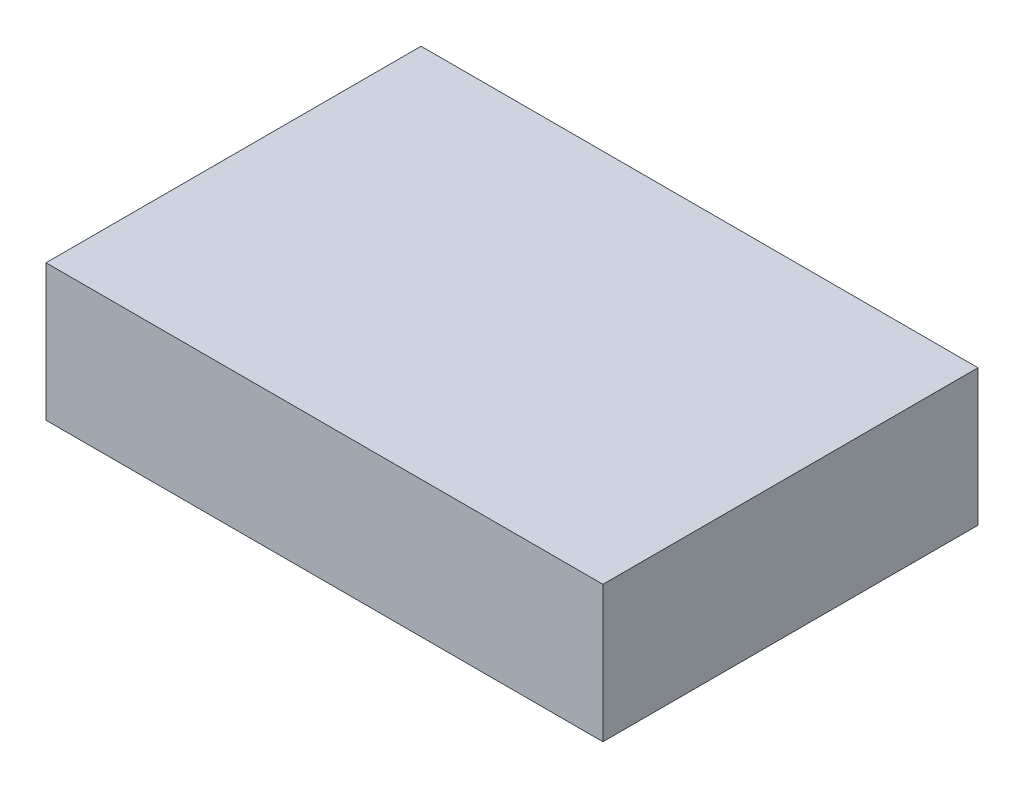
ISO-10303-21;
HEADER;
FILE_DESCRIPTION(('STEP AP214'),'2;1');
FILE_NAME('part.step','',(''),(''),'','','');
FILE_SCHEMA(('AUTOMOTIVE_DESIGN { 1 0 10303 214 1 1 1 1 }'));
ENDSEC;
DATA;
#1=APPLICATION_CONTEXT('core data for automotive mechanical design processes');
#2=APPLICATION_PROTOCOL_DEFINITION('international standard','automotive_design',2000,#1);
#3=PRODUCT_CONTEXT('',#1,'mechanical');
#4=PRODUCT('Part','Part','',(#3));
#5=PRODUCT_RELATED_PRODUCT_CATEGORY('part','',(#4));
#6=PRODUCT_DEFINITION_FORMATION('','',#4);
#7=PRODUCT_DEFINITION_CONTEXT('part definition',#1,'design');
#8=PRODUCT_DEFINITION('design','',#6,#7);
#9=PRODUCT_DEFINITION_SHAPE('','',#8);
#10=(LENGTH_UNIT() NAMED_UNIT(*) SI_UNIT(.MILLI.,.METRE.));
#11=(NAMED_UNIT(*) PLANE_ANGLE_UNIT() SI_UNIT($,.RADIAN.));
#12=(NAMED_UNIT(*) SI_UNIT($,.STERADIAN.) SOLID_ANGLE_UNIT());
#13=UNCERTAINTY_MEASURE_WITH_UNIT(LENGTH_MEASURE(1.E-05),#10,'distance_accuracy_value','');
#14=(GEOMETRIC_REPRESENTATION_CONTEXT(3) GLOBAL_UNCERTAINTY_ASSIGNED_CONTEXT((#13)) GLOBAL_UNIT_ASSIGNED_CONTEXT((#10,
#11,#12)) REPRESENTATION_CONTEXT('',''));
#15=CARTESIAN_POINT('',(0.,0.,0.));
#16=DIRECTION('',(0.,0.,1.));
#17=DIRECTION('',(1.,0.,0.));
#18=AXIS2_PLACEMENT_3D('',#15,#16,#17);
#19=CARTESIAN_POINT('',(24.5,12.,-16.5));
#20=DIRECTION('',(-1.,0.,0.));
#21=DIRECTION('',(0.,0.,1.));
#22=AXIS2_PLACEMENT_3D('',#19,#20,#21);
#23=PLANE('',#22);
#24=DIRECTION('',(0.,0.,-1.));
#25=VECTOR('',#24,1.);
#26=CARTESIAN_POINT('',(24.5,0.,-16.5));
#27=LINE('',#26,#25);
#28=CARTESIAN_POINT('',(24.5,0.,16.5));
#29=VERTEX_POINT('',#28);
#30=CARTESIAN_POINT('',(24.5,0.,-16.5));
#31=VERTEX_POINT('',#30);
#32=EDGE_CURVE('E98',#29,#31,#27,.T.);
#33=ORIENTED_EDGE('',*,*,#32,.T.);
#34=DIRECTION('',(0.,-1.,0.));
#35=VECTOR('',#34,1.);
#36=CARTESIAN_POINT('',(24.5,12.,-16.5));
#37=LINE('',#36,#35);
#38=CARTESIAN_POINT('',(24.5,12.,-16.5));
#39=VERTEX_POINT('',#38);
#40=EDGE_CURVE('E11',#39,#31,#37,.T.);
#41=ORIENTED_EDGE('',*,*,#40,.F.);
#42=DIRECTION('',(0.,0.,-1.));
#43=VECTOR('',#42,1.);
#44=CARTESIAN_POINT('',(24.5,12.,-16.5));
#45=LINE('',#44,#43);
#46=CARTESIAN_POINT('',(24.5,12.,16.5));
#47=VERTEX_POINT('',#46);
#48=EDGE_CURVE('E86',#47,#39,#45,.T.);
#49=ORIENTED_EDGE('',*,*,#48,.F.);
#50=DIRECTION('',(0.,-1.,0.));
#51=VECTOR('',#50,1.);
#52=CARTESIAN_POINT('',(24.5,12.,16.5));
#53=LINE('',#52,#51);
#54=EDGE_CURVE('E94',#47,#29,#53,.T.);
#55=ORIENTED_EDGE('',*,*,#54,.T.);
#56=EDGE_LOOP('',(#33,#41,#49,#55));
#57=FACE_BOUND('',#56,.T.);
#58=ADVANCED_FACE('F35',(#57),#23,.F.);
#59=CARTESIAN_POINT('',(-24.5,12.,-16.5));
#60=DIRECTION('',(0.,0.,1.));
#61=DIRECTION('',(1.,0.,0.));
#62=AXIS2_PLACEMENT_3D('',#59,#60,#61);
#63=PLANE('',#62);
#64=DIRECTION('',(-1.,0.,0.));
#65=VECTOR('',#64,1.);
#66=CARTESIAN_POINT('',(-24.5,0.,-16.5));
#67=LINE('',#66,#65);
#68=CARTESIAN_POINT('',(-24.5,0.,-16.5));
#69=VERTEX_POINT('',#68);
#70=EDGE_CURVE('E90',#31,#69,#67,.T.);
#71=ORIENTED_EDGE('',*,*,#70,.T.);
#72=DIRECTION('',(0.,-1.,0.));
#73=VECTOR('',#72,1.);
#74=CARTESIAN_POINT('',(-24.5,12.,-16.5));
#75=LINE('',#74,#73);
#76=CARTESIAN_POINT('',(-24.5,12.,-16.5));
#77=VERTEX_POINT('',#76);
#78=EDGE_CURVE('E43',#77,#69,#75,.T.);
#79=ORIENTED_EDGE('',*,*,#78,.F.);
#80=DIRECTION('',(-1.,0.,0.));
#81=VECTOR('',#80,1.);
#82=CARTESIAN_POINT('',(-24.5,12.,-16.5));
#83=LINE('',#82,#81);
#84=EDGE_CURVE('E81',#39,#77,#83,.T.);
#85=ORIENTED_EDGE('',*,*,#84,.F.);
#86=ORIENTED_EDGE('',*,*,#40,.T.);
#87=EDGE_LOOP('',(#71,#79,#85,#86));
#88=FACE_BOUND('',#87,.T.);
#89=ADVANCED_FACE('F89',(#88),#63,.F.);
#90=CARTESIAN_POINT('',(-24.5,12.,-16.5));
#91=DIRECTION('',(1.,0.,0.));
#92=DIRECTION('',(0.,0.,-1.));
#93=AXIS2_PLACEMENT_3D('',#90,#91,#92);
#94=PLANE('',#93);
#95=DIRECTION('',(0.,0.,1.));
#96=VECTOR('',#95,1.);
#97=CARTESIAN_POINT('',(-24.5,0.,-16.5));
#98=LINE('',#97,#96);
#99=CARTESIAN_POINT('',(-24.5,0.,16.5));
#100=VERTEX_POINT('',#99);
#101=EDGE_CURVE('E68',#69,#100,#98,.T.);
#102=ORIENTED_EDGE('',*,*,#101,.T.);
#103=DIRECTION('',(0.,-1.,0.));
#104=VECTOR('',#103,1.);
#105=CARTESIAN_POINT('',(-24.5,12.,16.5));
#106=LINE('',#105,#104);
#107=CARTESIAN_POINT('',(-24.5,12.,16.5));
#108=VERTEX_POINT('',#107);
#109=EDGE_CURVE('E91',#108,#100,#106,.T.);
#110=ORIENTED_EDGE('',*,*,#109,.F.);
#111=DIRECTION('',(0.,0.,1.));
#112=VECTOR('',#111,1.);
#113=CARTESIAN_POINT('',(-24.5,12.,-16.5));
#114=LINE('',#113,#112);
#115=EDGE_CURVE('E84',#77,#108,#114,.T.);
#116=ORIENTED_EDGE('',*,*,#115,.F.);
#117=ORIENTED_EDGE('',*,*,#78,.T.);
#118=EDGE_LOOP('',(#102,#110,#116,#117));
#119=FACE_BOUND('',#118,.T.);
#120=ADVANCED_FACE('F92',(#119),#94,.F.);
#121=CARTESIAN_POINT('',(-24.5,12.,16.5));
#122=DIRECTION('',(0.,0.,-1.));
#123=DIRECTION('',(-1.,0.,0.));
#124=AXIS2_PLACEMENT_3D('',#121,#122,#123);
#125=PLANE('',#124);
#126=DIRECTION('',(1.,0.,0.));
#127=VECTOR('',#126,1.);
#128=CARTESIAN_POINT('',(-24.5,0.,16.5));
#129=LINE('',#128,#127);
#130=EDGE_CURVE('E74',#100,#29,#129,.T.);
#131=ORIENTED_EDGE('',*,*,#130,.T.);
#132=ORIENTED_EDGE('',*,*,#54,.F.);
#133=DIRECTION('',(1.,0.,0.));
#134=VECTOR('',#133,1.);
#135=CARTESIAN_POINT('',(-24.5,12.,16.5));
#136=LINE('',#135,#134);
#137=EDGE_CURVE('E51',#108,#47,#136,.T.);
#138=ORIENTED_EDGE('',*,*,#137,.F.);
#139=ORIENTED_EDGE('',*,*,#109,.T.);
#140=EDGE_LOOP('',(#131,#132,#138,#139));
#141=FACE_BOUND('',#140,.T.);
#142=ADVANCED_FACE('F105',(#141),#125,.F.);
#143=CARTESIAN_POINT('',(0.,12.,0.));
#144=DIRECTION('',(0.,1.,0.));
#145=DIRECTION('',(0.,0.,1.));
#146=AXIS2_PLACEMENT_3D('',#143,#144,#145);
#147=PLANE('',#146);
#148=ORIENTED_EDGE('',*,*,#48,.T.);
#149=ORIENTED_EDGE('',*,*,#84,.T.);
#150=ORIENTED_EDGE('',*,*,#115,.T.);
#151=ORIENTED_EDGE('',*,*,#137,.T.);
#152=EDGE_LOOP('',(#148,#149,#150,#151));
#153=FACE_BOUND('',#152,.T.);
#154=ADVANCED_FACE('F82',(#153),#147,.T.);
#155=CARTESIAN_POINT('',(0.,0.,0.));
#156=DIRECTION('',(0.,1.,0.));
#157=DIRECTION('',(0.,0.,1.));
#158=AXIS2_PLACEMENT_3D('',#155,#156,#157);
#159=PLANE('',#158);
#160=ORIENTED_EDGE('',*,*,#32,.F.);
#161=ORIENTED_EDGE('',*,*,#130,.F.);
#162=ORIENTED_EDGE('',*,*,#101,.F.);
#163=ORIENTED_EDGE('',*,*,#70,.F.);
#164=EDGE_LOOP('',(#160,#161,#162,#163));
#165=FACE_BOUND('',#164,.T.);
#166=ADVANCED_FACE('F108',(#165),#159,.F.);
#167=CLOSED_SHELL('',(#58,#89,#120,#142,#154,#166));
#168=MANIFOLD_SOLID_BREP('B2',#167);
#169=ADVANCED_BREP_SHAPE_REPRESENTATION('',(#18,#168),#14);
#170=SHAPE_DEFINITION_REPRESENTATION(#9,#169);
ENDSEC;
END-ISO-10303-21;
